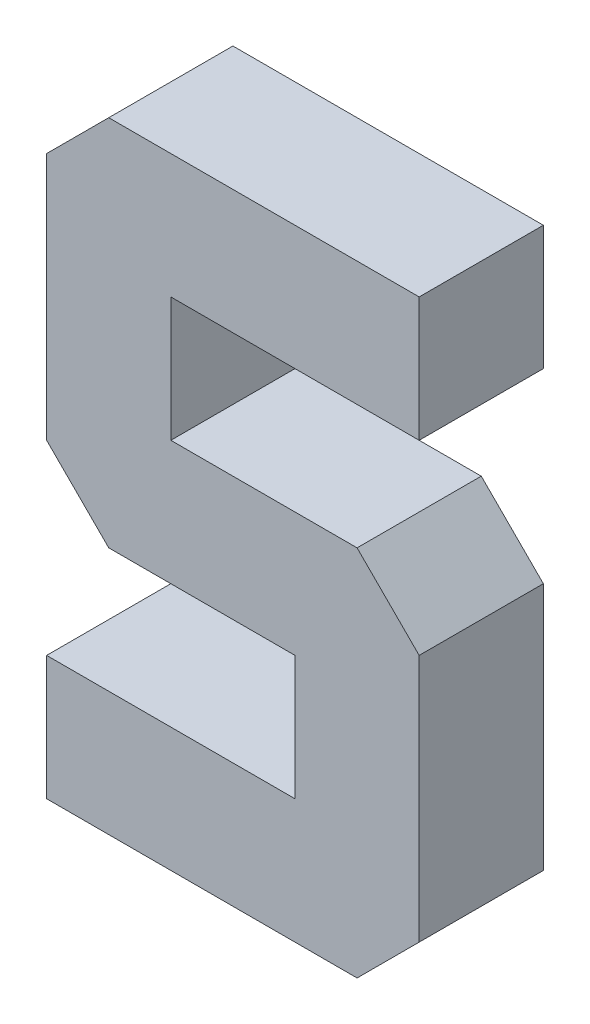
from build123d import *

# Parameters (mm, degrees)
BOSS_EXTRU_1_DEPTH = 10
CHANFREIN2_SIZE    = 5


with BuildPart() as part:
    # Esquisse1 → Boss.-Extru.1 (new body)
    with BuildSketch(Plane.XY):
        Polygon((30, 40), (30, 50), (0, 50), (0, 20), (20, 20), (20, 10), (0, 10), (0, 0), (30, 0), (30, 30), (10, 30), (10, 40), align=None)
    extrude(amount=BOSS_EXTRU_1_DEPTH)

    # Chanfrein2
    chanfrein2_edges = [part.edges().sort_by_distance(p)[0] for p in [
        (0, 20, 5),
        (0, 50, 5),
        (30, 30, 5),
        (30, 0, 5),
    ]]
    chamfer(chanfrein2_edges, length=CHANFREIN2_SIZE)


solid = part.part
